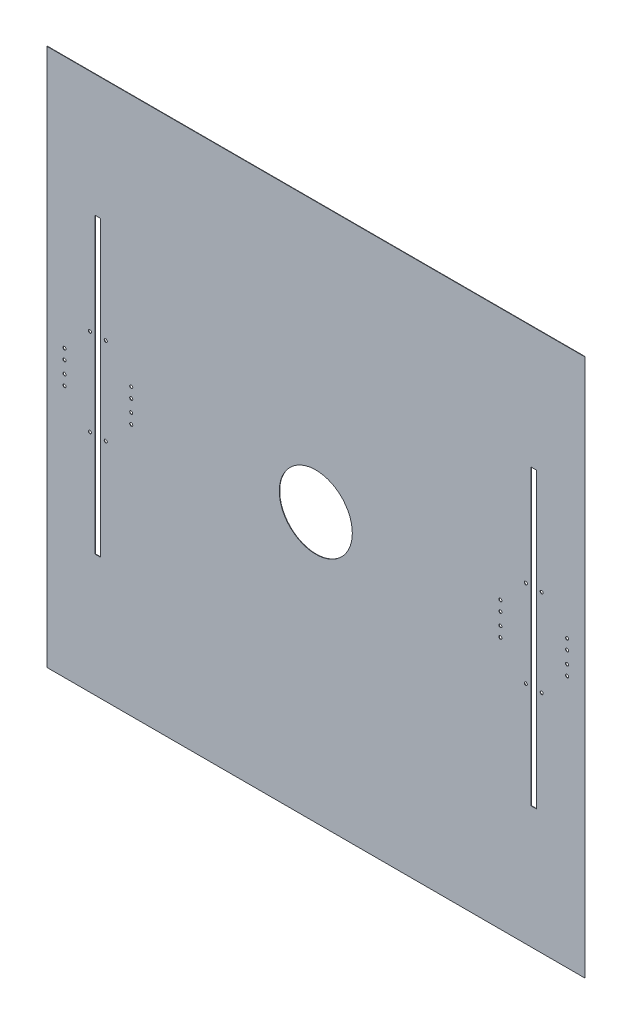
ISO-10303-21;
HEADER;
FILE_DESCRIPTION(('STEP AP214'),'2;1');
FILE_NAME('part.step','',(''),(''),'','','');
FILE_SCHEMA(('AUTOMOTIVE_DESIGN { 1 0 10303 214 1 1 1 1 }'));
ENDSEC;
DATA;
#1=APPLICATION_CONTEXT('core data for automotive mechanical design processes');
#2=APPLICATION_PROTOCOL_DEFINITION('international standard','automotive_design',2000,#1);
#3=PRODUCT_CONTEXT('',#1,'mechanical');
#4=PRODUCT('Part','Part','',(#3));
#5=PRODUCT_RELATED_PRODUCT_CATEGORY('part','',(#4));
#6=PRODUCT_DEFINITION_FORMATION('','',#4);
#7=PRODUCT_DEFINITION_CONTEXT('part definition',#1,'design');
#8=PRODUCT_DEFINITION('design','',#6,#7);
#9=PRODUCT_DEFINITION_SHAPE('','',#8);
#10=(LENGTH_UNIT() NAMED_UNIT(*) SI_UNIT(.MILLI.,.METRE.));
#11=(NAMED_UNIT(*) PLANE_ANGLE_UNIT() SI_UNIT($,.RADIAN.));
#12=(NAMED_UNIT(*) SI_UNIT($,.STERADIAN.) SOLID_ANGLE_UNIT());
#13=UNCERTAINTY_MEASURE_WITH_UNIT(LENGTH_MEASURE(1.E-05),#10,'distance_accuracy_value','');
#14=(GEOMETRIC_REPRESENTATION_CONTEXT(3) GLOBAL_UNCERTAINTY_ASSIGNED_CONTEXT((#13)) GLOBAL_UNIT_ASSIGNED_CONTEXT((#10,
#11,#12)) REPRESENTATION_CONTEXT('',''));
#15=CARTESIAN_POINT('',(0.,0.,0.));
#16=DIRECTION('',(0.,0.,1.));
#17=DIRECTION('',(1.,0.,0.));
#18=AXIS2_PLACEMENT_3D('',#15,#16,#17);
#19=CARTESIAN_POINT('',(-16.6671987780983,758.05667426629,-2.54));
#20=DIRECTION('',(-1.,0.,0.));
#21=DIRECTION('',(0.,0.,1.));
#22=AXIS2_PLACEMENT_3D('',#19,#20,#21);
#23=PLANE('',#22);
#24=DIRECTION('',(0.,-1.,0.));
#25=VECTOR('',#24,1.);
#26=CARTESIAN_POINT('',(-16.6671987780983,758.05667426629,0.));
#27=LINE('',#26,#25);
#28=CARTESIAN_POINT('',(-16.6671987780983,758.05667426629,0.));
#29=VERTEX_POINT('',#28);
#30=CARTESIAN_POINT('',(-16.6671987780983,-2594.74332573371,0.));
#31=VERTEX_POINT('',#30);
#32=EDGE_CURVE('E338',#29,#31,#27,.T.);
#33=ORIENTED_EDGE('',*,*,#32,.F.);
#34=DIRECTION('',(0.,0.,1.));
#35=VECTOR('',#34,1.);
#36=CARTESIAN_POINT('',(-16.6671987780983,758.05667426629,-2.54));
#37=LINE('',#36,#35);
#38=CARTESIAN_POINT('',(-16.6671987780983,758.05667426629,-2.54));
#39=VERTEX_POINT('',#38);
#40=EDGE_CURVE('E11',#39,#29,#37,.T.);
#41=ORIENTED_EDGE('',*,*,#40,.F.);
#42=DIRECTION('',(0.,-1.,0.));
#43=VECTOR('',#42,1.);
#44=CARTESIAN_POINT('',(-16.6671987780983,758.05667426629,-2.54));
#45=LINE('',#44,#43);
#46=CARTESIAN_POINT('',(-16.6671987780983,-2594.74332573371,-2.54));
#47=VERTEX_POINT('',#46);
#48=EDGE_CURVE('E341',#39,#47,#45,.T.);
#49=ORIENTED_EDGE('',*,*,#48,.T.);
#50=DIRECTION('',(0.,0.,1.));
#51=VECTOR('',#50,1.);
#52=CARTESIAN_POINT('',(-16.6671987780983,-2594.74332573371,-2.54));
#53=LINE('',#52,#51);
#54=EDGE_CURVE('E36',#47,#31,#53,.T.);
#55=ORIENTED_EDGE('',*,*,#54,.T.);
#56=EDGE_LOOP('',(#33,#41,#49,#55));
#57=FACE_BOUND('',#56,.T.);
#58=ADVANCED_FACE('F33',(#57),#23,.T.);
#59=CARTESIAN_POINT('',(-16.6671987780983,758.05667426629,-2.54));
#60=DIRECTION('',(0.,1.,0.));
#61=DIRECTION('',(-1.,0.,0.));
#62=AXIS2_PLACEMENT_3D('',#59,#60,#61);
#63=PLANE('',#62);
#64=DIRECTION('',(-1.,0.,0.));
#65=VECTOR('',#64,1.);
#66=CARTESIAN_POINT('',(-16.6671987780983,758.05667426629,0.));
#67=LINE('',#66,#65);
#68=CARTESIAN_POINT('',(3336.1328012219,758.056674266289,0.));
#69=VERTEX_POINT('',#68);
#70=EDGE_CURVE('E345',#69,#29,#67,.T.);
#71=ORIENTED_EDGE('',*,*,#70,.F.);
#72=DIRECTION('',(0.,0.,1.));
#73=VECTOR('',#72,1.);
#74=CARTESIAN_POINT('',(3336.1328012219,758.056674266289,-2.54));
#75=LINE('',#74,#73);
#76=CARTESIAN_POINT('',(3336.1328012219,758.056674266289,-2.54));
#77=VERTEX_POINT('',#76);
#78=EDGE_CURVE('E41',#77,#69,#75,.T.);
#79=ORIENTED_EDGE('',*,*,#78,.F.);
#80=DIRECTION('',(-1.,0.,0.));
#81=VECTOR('',#80,1.);
#82=CARTESIAN_POINT('',(-16.6671987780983,758.05667426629,-2.54));
#83=LINE('',#82,#81);
#84=EDGE_CURVE('E351',#77,#39,#83,.T.);
#85=ORIENTED_EDGE('',*,*,#84,.T.);
#86=ORIENTED_EDGE('',*,*,#40,.T.);
#87=EDGE_LOOP('',(#71,#79,#85,#86));
#88=FACE_BOUND('',#87,.T.);
#89=ADVANCED_FACE('F377',(#88),#63,.T.);
#90=CARTESIAN_POINT('',(3336.1328012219,758.056674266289,-2.54));
#91=DIRECTION('',(1.,0.,0.));
#92=DIRECTION('',(0.,1.,0.));
#93=AXIS2_PLACEMENT_3D('',#90,#91,#92);
#94=PLANE('',#93);
#95=DIRECTION('',(0.,1.,0.));
#96=VECTOR('',#95,1.);
#97=CARTESIAN_POINT('',(3336.1328012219,758.056674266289,0.));
#98=LINE('',#97,#96);
#99=CARTESIAN_POINT('',(3336.1328012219,-2594.74332573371,0.));
#100=VERTEX_POINT('',#99);
#101=EDGE_CURVE('E359',#100,#69,#98,.T.);
#102=ORIENTED_EDGE('',*,*,#101,.F.);
#103=DIRECTION('',(0.,0.,1.));
#104=VECTOR('',#103,1.);
#105=CARTESIAN_POINT('',(3336.1328012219,-2594.74332573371,-2.54));
#106=LINE('',#105,#104);
#107=CARTESIAN_POINT('',(3336.1328012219,-2594.74332573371,-2.54));
#108=VERTEX_POINT('',#107);
#109=EDGE_CURVE('E364',#108,#100,#106,.T.);
#110=ORIENTED_EDGE('',*,*,#109,.F.);
#111=DIRECTION('',(0.,1.,0.));
#112=VECTOR('',#111,1.);
#113=CARTESIAN_POINT('',(3336.1328012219,758.056674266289,-2.54));
#114=LINE('',#113,#112);
#115=EDGE_CURVE('E348',#108,#77,#114,.T.);
#116=ORIENTED_EDGE('',*,*,#115,.T.);
#117=ORIENTED_EDGE('',*,*,#78,.T.);
#118=EDGE_LOOP('',(#102,#110,#116,#117));
#119=FACE_BOUND('',#118,.T.);
#120=ADVANCED_FACE('F382',(#119),#94,.T.);
#121=CARTESIAN_POINT('',(-16.6671987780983,-2594.74332573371,-2.54));
#122=DIRECTION('',(0.,-1.,0.));
#123=DIRECTION('',(1.,0.,0.));
#124=AXIS2_PLACEMENT_3D('',#121,#122,#123);
#125=PLANE('',#124);
#126=DIRECTION('',(1.,0.,0.));
#127=VECTOR('',#126,1.);
#128=CARTESIAN_POINT('',(-16.6671987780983,-2594.74332573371,0.));
#129=LINE('',#128,#127);
#130=EDGE_CURVE('E356',#31,#100,#129,.T.);
#131=ORIENTED_EDGE('',*,*,#130,.F.);
#132=ORIENTED_EDGE('',*,*,#54,.F.);
#133=DIRECTION('',(1.,0.,0.));
#134=VECTOR('',#133,1.);
#135=CARTESIAN_POINT('',(-16.6671987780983,-2594.74332573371,-2.54));
#136=LINE('',#135,#134);
#137=EDGE_CURVE('E344',#47,#108,#136,.T.);
#138=ORIENTED_EDGE('',*,*,#137,.T.);
#139=ORIENTED_EDGE('',*,*,#109,.T.);
#140=EDGE_LOOP('',(#131,#132,#138,#139));
#141=FACE_BOUND('',#140,.T.);
#142=ADVANCED_FACE('F372',(#141),#125,.T.);
#143=CARTESIAN_POINT('',(0.,0.,-2.54));
#144=DIRECTION('',(0.,0.,1.));
#145=DIRECTION('',(1.,0.,0.));
#146=AXIS2_PLACEMENT_3D('',#143,#144,#145);
#147=PLANE('',#146);
#148=DIRECTION('',(-1.,0.,0.));
#149=VECTOR('',#148,1.);
#150=CARTESIAN_POINT('',(3000.09905833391,-3.94332573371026,-2.54));
#151=LINE('',#150,#149);
#152=CARTESIAN_POINT('',(3036.02008281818,-3.94332573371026,-2.54));
#153=VERTEX_POINT('',#152);
#154=CARTESIAN_POINT('',(3000.09905833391,-3.94332573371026,-2.54));
#155=VERTEX_POINT('',#154);
#156=EDGE_CURVE('E130',#153,#155,#151,.T.);
#157=ORIENTED_EDGE('',*,*,#156,.T.);
#158=DIRECTION('',(0.,-1.,0.));
#159=VECTOR('',#158,1.);
#160=CARTESIAN_POINT('',(3000.09905833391,-1832.74332573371,-2.54));
#161=LINE('',#160,#159);
#162=CARTESIAN_POINT('',(3000.09905833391,-1832.74332573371,-2.54));
#163=VERTEX_POINT('',#162);
#164=EDGE_CURVE('E124',#155,#163,#161,.T.);
#165=ORIENTED_EDGE('',*,*,#164,.T.);
#166=DIRECTION('',(1.,0.,0.));
#167=VECTOR('',#166,1.);
#168=CARTESIAN_POINT('',(3000.09905833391,-1832.74332573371,-2.54));
#169=LINE('',#168,#167);
#170=CARTESIAN_POINT('',(3036.02008281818,-1832.74332573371,-2.54));
#171=VERTEX_POINT('',#170);
#172=EDGE_CURVE('E133',#163,#171,#169,.T.);
#173=ORIENTED_EDGE('',*,*,#172,.T.);
#174=DIRECTION('',(0.,1.,0.));
#175=VECTOR('',#174,1.);
#176=CARTESIAN_POINT('',(3036.02008281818,-1832.74332573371,-2.54));
#177=LINE('',#176,#175);
#178=EDGE_CURVE('E49',#171,#153,#177,.T.);
#179=ORIENTED_EDGE('',*,*,#178,.T.);
#180=EDGE_LOOP('',(#157,#165,#173,#179));
#181=FACE_BOUND('',#180,.T.);
#182=CARTESIAN_POINT('',(1659.7328012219,-918.34332573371,-2.54));
#183=DIRECTION('',(0.,0.,1.));
#184=DIRECTION('',(1.,0.,0.));
#185=AXIS2_PLACEMENT_3D('',#182,#183,#184);
#186=CIRCLE('',#185,227.582044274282);
#187=CARTESIAN_POINT('',(1887.31484549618,-918.34332573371,-2.54));
#188=VERTEX_POINT('',#187);
#189=EDGE_CURVE('E159',#188,#188,#186,.T.);
#190=ORIENTED_EDGE('',*,*,#189,.T.);
#191=EDGE_LOOP('',(#190));
#192=FACE_BOUND('',#191,.T.);
#193=DIRECTION('',(-1.,0.,0.));
#194=VECTOR('',#193,1.);
#195=CARTESIAN_POINT('',(283.515165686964,-3.94332573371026,-2.54));
#196=LINE('',#195,#194);
#197=CARTESIAN_POINT('',(319.43619017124,-3.94332573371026,-2.54));
#198=VERTEX_POINT('',#197);
#199=CARTESIAN_POINT('',(283.515165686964,-3.94332573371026,-2.54));
#200=VERTEX_POINT('',#199);
#201=EDGE_CURVE('E175',#198,#200,#196,.T.);
#202=ORIENTED_EDGE('',*,*,#201,.T.);
#203=DIRECTION('',(0.,-1.,0.));
#204=VECTOR('',#203,1.);
#205=CARTESIAN_POINT('',(283.515165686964,-3.94332573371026,-2.54));
#206=LINE('',#205,#204);
#207=CARTESIAN_POINT('',(283.515165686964,-1832.74332573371,-2.54));
#208=VERTEX_POINT('',#207);
#209=EDGE_CURVE('E165',#200,#208,#206,.T.);
#210=ORIENTED_EDGE('',*,*,#209,.T.);
#211=DIRECTION('',(1.,0.,0.));
#212=VECTOR('',#211,1.);
#213=CARTESIAN_POINT('',(283.515165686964,-1832.74332573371,-2.54));
#214=LINE('',#213,#212);
#215=CARTESIAN_POINT('',(319.43619017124,-1832.74332573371,-2.54));
#216=VERTEX_POINT('',#215);
#217=EDGE_CURVE('E168',#208,#216,#214,.T.);
#218=ORIENTED_EDGE('',*,*,#217,.T.);
#219=DIRECTION('',(0.,1.,0.));
#220=VECTOR('',#219,1.);
#221=CARTESIAN_POINT('',(319.43619017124,-3.94332573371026,-2.54));
#222=LINE('',#221,#220);
#223=EDGE_CURVE('E172',#216,#198,#222,.T.);
#224=ORIENTED_EDGE('',*,*,#223,.T.);
#225=EDGE_LOOP('',(#202,#210,#218,#224));
#226=FACE_BOUND('',#225,.T.);
#227=CARTESIAN_POINT('',(3067.27207057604,-1189.77906961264,-2.54));
#228=DIRECTION('',(0.,0.,1.));
#229=DIRECTION('',(1.,0.,0.));
#230=AXIS2_PLACEMENT_3D('',#227,#228,#229);
#231=CIRCLE('',#230,9.52499999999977);
#232=CARTESIAN_POINT('',(3076.79707057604,-1189.77906961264,-2.54));
#233=VERTEX_POINT('',#232);
#234=EDGE_CURVE('E197',#233,#233,#231,.T.);
#235=ORIENTED_EDGE('',*,*,#234,.T.);
#236=EDGE_LOOP('',(#235));
#237=FACE_BOUND('',#236,.T.);
#238=CARTESIAN_POINT('',(2968.84707057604,-1189.77906961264,-2.54));
#239=DIRECTION('',(0.,0.,1.));
#240=DIRECTION('',(1.,0.,0.));
#241=AXIS2_PLACEMENT_3D('',#238,#239,#240);
#242=CIRCLE('',#241,9.52499999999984);
#243=CARTESIAN_POINT('',(2978.37207057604,-1189.77906961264,-2.54));
#244=VERTEX_POINT('',#243);
#245=EDGE_CURVE('E203',#244,#244,#242,.T.);
#246=ORIENTED_EDGE('',*,*,#245,.T.);
#247=EDGE_LOOP('',(#246));
#248=FACE_BOUND('',#247,.T.);
#249=CARTESIAN_POINT('',(3067.27207057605,-646.90758185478,-2.54));
#250=DIRECTION('',(0.,0.,1.));
#251=DIRECTION('',(1.,0.,0.));
#252=AXIS2_PLACEMENT_3D('',#249,#250,#251);
#253=CIRCLE('',#252,9.52499999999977);
#254=CARTESIAN_POINT('',(3076.79707057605,-646.90758185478,-2.54));
#255=VERTEX_POINT('',#254);
#256=EDGE_CURVE('E209',#255,#255,#253,.T.);
#257=ORIENTED_EDGE('',*,*,#256,.T.);
#258=EDGE_LOOP('',(#257));
#259=FACE_BOUND('',#258,.T.);
#260=CARTESIAN_POINT('',(2968.84707057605,-646.90758185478,-2.54));
#261=DIRECTION('',(0.,0.,1.));
#262=DIRECTION('',(1.,0.,0.));
#263=AXIS2_PLACEMENT_3D('',#260,#261,#262);
#264=CIRCLE('',#263,9.52499999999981);
#265=CARTESIAN_POINT('',(2978.37207057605,-646.90758185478,-2.54));
#266=VERTEX_POINT('',#265);
#267=EDGE_CURVE('E215',#266,#266,#264,.T.);
#268=ORIENTED_EDGE('',*,*,#267,.T.);
#269=EDGE_LOOP('',(#268));
#270=FACE_BOUND('',#269,.T.);
#271=CARTESIAN_POINT('',(2810.09707057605,-816.743325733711,-2.54));
#272=DIRECTION('',(0.,0.,1.));
#273=DIRECTION('',(1.,0.,0.));
#274=AXIS2_PLACEMENT_3D('',#271,#272,#273);
#275=CIRCLE('',#274,9.52500000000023);
#276=CARTESIAN_POINT('',(2819.62207057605,-816.743325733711,-2.54));
#277=VERTEX_POINT('',#276);
#278=EDGE_CURVE('E221',#277,#277,#275,.T.);
#279=ORIENTED_EDGE('',*,*,#278,.T.);
#280=EDGE_LOOP('',(#279));
#281=FACE_BOUND('',#280,.T.);
#282=CARTESIAN_POINT('',(2810.09707057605,-880.243325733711,-2.54));
#283=DIRECTION('',(0.,0.,1.));
#284=DIRECTION('',(1.,0.,0.));
#285=AXIS2_PLACEMENT_3D('',#282,#283,#284);
#286=CIRCLE('',#285,9.52499999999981);
#287=CARTESIAN_POINT('',(2819.62207057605,-880.243325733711,-2.54));
#288=VERTEX_POINT('',#287);
#289=EDGE_CURVE('E227',#288,#288,#286,.T.);
#290=ORIENTED_EDGE('',*,*,#289,.T.);
#291=EDGE_LOOP('',(#290));
#292=FACE_BOUND('',#291,.T.);
#293=CARTESIAN_POINT('',(2810.09707057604,-956.443325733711,-2.54));
#294=DIRECTION('',(0.,0.,1.));
#295=DIRECTION('',(1.,0.,0.));
#296=AXIS2_PLACEMENT_3D('',#293,#294,#295);
#297=CIRCLE('',#296,9.52499999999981);
#298=CARTESIAN_POINT('',(2819.62207057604,-956.443325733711,-2.54));
#299=VERTEX_POINT('',#298);
#300=EDGE_CURVE('E233',#299,#299,#297,.T.);
#301=ORIENTED_EDGE('',*,*,#300,.T.);
#302=EDGE_LOOP('',(#301));
#303=FACE_BOUND('',#302,.T.);
#304=CARTESIAN_POINT('',(2810.09707057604,-1019.94332573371,-2.54));
#305=DIRECTION('',(0.,0.,1.));
#306=DIRECTION('',(1.,0.,0.));
#307=AXIS2_PLACEMENT_3D('',#304,#305,#306);
#308=CIRCLE('',#307,9.52499999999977);
#309=CARTESIAN_POINT('',(2819.62207057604,-1019.94332573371,-2.54));
#310=VERTEX_POINT('',#309);
#311=EDGE_CURVE('E239',#310,#310,#308,.T.);
#312=ORIENTED_EDGE('',*,*,#311,.T.);
#313=EDGE_LOOP('',(#312));
#314=FACE_BOUND('',#313,.T.);
#315=CARTESIAN_POINT('',(3226.02207057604,-1019.94332573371,-2.54));
#316=DIRECTION('',(0.,0.,1.));
#317=DIRECTION('',(1.,0.,0.));
#318=AXIS2_PLACEMENT_3D('',#315,#316,#317);
#319=CIRCLE('',#318,9.52500000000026);
#320=CARTESIAN_POINT('',(3235.54707057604,-1019.94332573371,-2.54));
#321=VERTEX_POINT('',#320);
#322=EDGE_CURVE('E245',#321,#321,#319,.T.);
#323=ORIENTED_EDGE('',*,*,#322,.T.);
#324=EDGE_LOOP('',(#323));
#325=FACE_BOUND('',#324,.T.);
#326=CARTESIAN_POINT('',(3226.02207057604,-956.44332573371,-2.54));
#327=DIRECTION('',(0.,0.,1.));
#328=DIRECTION('',(1.,0.,0.));
#329=AXIS2_PLACEMENT_3D('',#326,#327,#328);
#330=CIRCLE('',#329,9.52500000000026);
#331=CARTESIAN_POINT('',(3235.54707057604,-956.44332573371,-2.54));
#332=VERTEX_POINT('',#331);
#333=EDGE_CURVE('E251',#332,#332,#330,.T.);
#334=ORIENTED_EDGE('',*,*,#333,.T.);
#335=EDGE_LOOP('',(#334));
#336=FACE_BOUND('',#335,.T.);
#337=CARTESIAN_POINT('',(3226.02207057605,-880.24332573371,-2.54));
#338=DIRECTION('',(0.,0.,1.));
#339=DIRECTION('',(1.,0.,0.));
#340=AXIS2_PLACEMENT_3D('',#337,#338,#339);
#341=CIRCLE('',#340,9.52499999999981);
#342=CARTESIAN_POINT('',(3235.54707057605,-880.24332573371,-2.54));
#343=VERTEX_POINT('',#342);
#344=EDGE_CURVE('E257',#343,#343,#341,.T.);
#345=ORIENTED_EDGE('',*,*,#344,.T.);
#346=EDGE_LOOP('',(#345));
#347=FACE_BOUND('',#346,.T.);
#348=CARTESIAN_POINT('',(3226.02207057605,-816.74332573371,-2.54));
#349=DIRECTION('',(0.,0.,1.));
#350=DIRECTION('',(1.,0.,0.));
#351=AXIS2_PLACEMENT_3D('',#348,#349,#350);
#352=CIRCLE('',#351,9.52500000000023);
#353=CARTESIAN_POINT('',(3235.54707057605,-816.74332573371,-2.54));
#354=VERTEX_POINT('',#353);
#355=EDGE_CURVE('E263',#354,#354,#352,.T.);
#356=ORIENTED_EDGE('',*,*,#355,.T.);
#357=EDGE_LOOP('',(#356));
#358=FACE_BOUND('',#357,.T.);
#359=CARTESIAN_POINT('',(509.438177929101,-880.243325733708,-2.54));
#360=DIRECTION('',(0.,0.,1.));
#361=DIRECTION('',(1.,0.,0.));
#362=AXIS2_PLACEMENT_3D('',#359,#360,#361);
#363=CIRCLE('',#362,9.52500000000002);
#364=CARTESIAN_POINT('',(518.963177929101,-880.243325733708,-2.54));
#365=VERTEX_POINT('',#364);
#366=EDGE_CURVE('E269',#365,#365,#363,.T.);
#367=ORIENTED_EDGE('',*,*,#366,.T.);
#368=EDGE_LOOP('',(#367));
#369=FACE_BOUND('',#368,.T.);
#370=CARTESIAN_POINT('',(509.438177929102,-956.44332573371,-2.54));
#371=DIRECTION('',(0.,0.,1.));
#372=DIRECTION('',(1.,0.,0.));
#373=AXIS2_PLACEMENT_3D('',#370,#371,#372);
#374=CIRCLE('',#373,9.52500000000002);
#375=CARTESIAN_POINT('',(518.963177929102,-956.44332573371,-2.54));
#376=VERTEX_POINT('',#375);
#377=EDGE_CURVE('E275',#376,#376,#374,.T.);
#378=ORIENTED_EDGE('',*,*,#377,.T.);
#379=EDGE_LOOP('',(#378));
#380=FACE_BOUND('',#379,.T.);
#381=CARTESIAN_POINT('',(509.438177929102,-1019.94332573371,-2.54));
#382=DIRECTION('',(0.,0.,1.));
#383=DIRECTION('',(1.,0.,0.));
#384=AXIS2_PLACEMENT_3D('',#381,#382,#383);
#385=CIRCLE('',#384,9.52499999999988);
#386=CARTESIAN_POINT('',(518.963177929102,-1019.94332573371,-2.54));
#387=VERTEX_POINT('',#386);
#388=EDGE_CURVE('E281',#387,#387,#385,.T.);
#389=ORIENTED_EDGE('',*,*,#388,.T.);
#390=EDGE_LOOP('',(#389));
#391=FACE_BOUND('',#390,.T.);
#392=CARTESIAN_POINT('',(350.688177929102,-1189.77906961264,-2.54));
#393=DIRECTION('',(0.,0.,1.));
#394=DIRECTION('',(1.,0.,0.));
#395=AXIS2_PLACEMENT_3D('',#392,#393,#394);
#396=CIRCLE('',#395,9.52500000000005);
#397=CARTESIAN_POINT('',(360.213177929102,-1189.77906961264,-2.54));
#398=VERTEX_POINT('',#397);
#399=EDGE_CURVE('E287',#398,#398,#396,.T.);
#400=ORIENTED_EDGE('',*,*,#399,.T.);
#401=EDGE_LOOP('',(#400));
#402=FACE_BOUND('',#401,.T.);
#403=CARTESIAN_POINT('',(252.263177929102,-1189.77906961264,-2.54));
#404=DIRECTION('',(0.,0.,1.));
#405=DIRECTION('',(1.,0.,0.));
#406=AXIS2_PLACEMENT_3D('',#403,#404,#405);
#407=CIRCLE('',#406,9.52500000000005);
#408=CARTESIAN_POINT('',(261.788177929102,-1189.77906961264,-2.54));
#409=VERTEX_POINT('',#408);
#410=EDGE_CURVE('E293',#409,#409,#407,.T.);
#411=ORIENTED_EDGE('',*,*,#410,.T.);
#412=EDGE_LOOP('',(#411));
#413=FACE_BOUND('',#412,.T.);
#414=CARTESIAN_POINT('',(93.5131779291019,-1019.94332573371,-2.54));
#415=DIRECTION('',(0.,0.,1.));
#416=DIRECTION('',(1.,0.,0.));
#417=AXIS2_PLACEMENT_3D('',#414,#415,#416);
#418=CIRCLE('',#417,9.52500000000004);
#419=CARTESIAN_POINT('',(103.038177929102,-1019.94332573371,-2.54));
#420=VERTEX_POINT('',#419);
#421=EDGE_CURVE('E299',#420,#420,#418,.T.);
#422=ORIENTED_EDGE('',*,*,#421,.T.);
#423=EDGE_LOOP('',(#422));
#424=FACE_BOUND('',#423,.T.);
#425=CARTESIAN_POINT('',(93.5131779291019,-956.44332573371,-2.54));
#426=DIRECTION('',(0.,0.,1.));
#427=DIRECTION('',(1.,0.,0.));
#428=AXIS2_PLACEMENT_3D('',#425,#426,#427);
#429=CIRCLE('',#428,9.52499999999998);
#430=CARTESIAN_POINT('',(103.038177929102,-956.44332573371,-2.54));
#431=VERTEX_POINT('',#430);
#432=EDGE_CURVE('E305',#431,#431,#429,.T.);
#433=ORIENTED_EDGE('',*,*,#432,.T.);
#434=EDGE_LOOP('',(#433));
#435=FACE_BOUND('',#434,.T.);
#436=CARTESIAN_POINT('',(93.5131779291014,-880.243325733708,-2.54));
#437=DIRECTION('',(0.,0.,1.));
#438=DIRECTION('',(1.,0.,0.));
#439=AXIS2_PLACEMENT_3D('',#436,#437,#438);
#440=CIRCLE('',#439,9.52499999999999);
#441=CARTESIAN_POINT('',(103.038177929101,-880.243325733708,-2.54));
#442=VERTEX_POINT('',#441);
#443=EDGE_CURVE('E311',#442,#442,#440,.T.);
#444=ORIENTED_EDGE('',*,*,#443,.T.);
#445=EDGE_LOOP('',(#444));
#446=FACE_BOUND('',#445,.T.);
#447=CARTESIAN_POINT('',(93.5131779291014,-816.743325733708,-2.54));
#448=DIRECTION('',(0.,0.,1.));
#449=DIRECTION('',(1.,0.,0.));
#450=AXIS2_PLACEMENT_3D('',#447,#448,#449);
#451=CIRCLE('',#450,9.525);
#452=CARTESIAN_POINT('',(103.038177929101,-816.743325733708,-2.54));
#453=VERTEX_POINT('',#452);
#454=EDGE_CURVE('E317',#453,#453,#451,.T.);
#455=ORIENTED_EDGE('',*,*,#454,.T.);
#456=EDGE_LOOP('',(#455));
#457=FACE_BOUND('',#456,.T.);
#458=CARTESIAN_POINT('',(509.438177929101,-816.743325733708,-2.54));
#459=DIRECTION('',(0.,0.,1.));
#460=DIRECTION('',(1.,0.,0.));
#461=AXIS2_PLACEMENT_3D('',#458,#459,#460);
#462=CIRCLE('',#461,9.67520100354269);
#463=CARTESIAN_POINT('',(519.113378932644,-816.743325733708,-2.54));
#464=VERTEX_POINT('',#463);
#465=EDGE_CURVE('E323',#464,#464,#462,.T.);
#466=ORIENTED_EDGE('',*,*,#465,.T.);
#467=EDGE_LOOP('',(#466));
#468=FACE_BOUND('',#467,.T.);
#469=CARTESIAN_POINT('',(350.688177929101,-646.907581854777,-2.54));
#470=DIRECTION('',(0.,0.,1.));
#471=DIRECTION('',(1.,0.,0.));
#472=AXIS2_PLACEMENT_3D('',#469,#470,#471);
#473=CIRCLE('',#472,9.52499999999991);
#474=CARTESIAN_POINT('',(360.213177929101,-646.907581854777,-2.54));
#475=VERTEX_POINT('',#474);
#476=EDGE_CURVE('E329',#475,#475,#473,.T.);
#477=ORIENTED_EDGE('',*,*,#476,.T.);
#478=EDGE_LOOP('',(#477));
#479=FACE_BOUND('',#478,.T.);
#480=CARTESIAN_POINT('',(252.263177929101,-646.907581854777,-2.54));
#481=DIRECTION('',(0.,0.,1.));
#482=DIRECTION('',(1.,0.,0.));
#483=AXIS2_PLACEMENT_3D('',#480,#481,#482);
#484=CIRCLE('',#483,9.52499999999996);
#485=CARTESIAN_POINT('',(261.788177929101,-646.907581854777,-2.54));
#486=VERTEX_POINT('',#485);
#487=EDGE_CURVE('E335',#486,#486,#484,.T.);
#488=ORIENTED_EDGE('',*,*,#487,.T.);
#489=EDGE_LOOP('',(#488));
#490=FACE_BOUND('',#489,.T.);
#491=ORIENTED_EDGE('',*,*,#48,.F.);
#492=ORIENTED_EDGE('',*,*,#84,.F.);
#493=ORIENTED_EDGE('',*,*,#115,.F.);
#494=ORIENTED_EDGE('',*,*,#137,.F.);
#495=EDGE_LOOP('',(#491,#492,#493,#494));
#496=FACE_BOUND('',#495,.T.);
#497=ADVANCED_FACE('F137',(#181,#192,#226,#237,#248,#259,#270,#281,#292,#303,#314,#325,#336,
#347,#358,#369,#380,#391,#402,#413,#424,#435,#446,#457,#468,#479,#490,#496),#147,.F.);
#498=CARTESIAN_POINT('',(0.,0.,0.));
#499=DIRECTION('',(0.,0.,1.));
#500=DIRECTION('',(1.,0.,0.));
#501=AXIS2_PLACEMENT_3D('',#498,#499,#500);
#502=PLANE('',#501);
#503=DIRECTION('',(0.,-1.,0.));
#504=VECTOR('',#503,1.);
#505=CARTESIAN_POINT('',(3000.09905833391,-1832.74332573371,0.));
#506=LINE('',#505,#504);
#507=CARTESIAN_POINT('',(3000.09905833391,-3.94332573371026,0.));
#508=VERTEX_POINT('',#507);
#509=CARTESIAN_POINT('',(3000.09905833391,-1832.74332573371,0.));
#510=VERTEX_POINT('',#509);
#511=EDGE_CURVE('E57',#508,#510,#506,.T.);
#512=ORIENTED_EDGE('',*,*,#511,.F.);
#513=DIRECTION('',(-1.,0.,0.));
#514=VECTOR('',#513,1.);
#515=CARTESIAN_POINT('',(3000.09905833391,-3.94332573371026,0.));
#516=LINE('',#515,#514);
#517=CARTESIAN_POINT('',(3036.02008281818,-3.94332573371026,0.));
#518=VERTEX_POINT('',#517);
#519=EDGE_CURVE('E140',#518,#508,#516,.T.);
#520=ORIENTED_EDGE('',*,*,#519,.F.);
#521=DIRECTION('',(0.,1.,0.));
#522=VECTOR('',#521,1.);
#523=CARTESIAN_POINT('',(3036.02008281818,-1832.74332573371,0.));
#524=LINE('',#523,#522);
#525=CARTESIAN_POINT('',(3036.02008281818,-1832.74332573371,0.));
#526=VERTEX_POINT('',#525);
#527=EDGE_CURVE('E143',#526,#518,#524,.T.);
#528=ORIENTED_EDGE('',*,*,#527,.F.);
#529=DIRECTION('',(1.,0.,0.));
#530=VECTOR('',#529,1.);
#531=CARTESIAN_POINT('',(3000.09905833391,-1832.74332573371,0.));
#532=LINE('',#531,#530);
#533=EDGE_CURVE('E149',#510,#526,#532,.T.);
#534=ORIENTED_EDGE('',*,*,#533,.F.);
#535=EDGE_LOOP('',(#512,#520,#528,#534));
#536=FACE_BOUND('',#535,.T.);
#537=CARTESIAN_POINT('',(1659.7328012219,-918.34332573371,0.));
#538=DIRECTION('',(0.,0.,1.));
#539=DIRECTION('',(1.,0.,0.));
#540=AXIS2_PLACEMENT_3D('',#537,#538,#539);
#541=CIRCLE('',#540,227.582044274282);
#542=CARTESIAN_POINT('',(1887.31484549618,-918.34332573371,0.));
#543=VERTEX_POINT('',#542);
#544=EDGE_CURVE('E155',#543,#543,#541,.T.);
#545=ORIENTED_EDGE('',*,*,#544,.F.);
#546=EDGE_LOOP('',(#545));
#547=FACE_BOUND('',#546,.T.);
#548=DIRECTION('',(0.,-1.,0.));
#549=VECTOR('',#548,1.);
#550=CARTESIAN_POINT('',(283.515165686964,-3.94332573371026,0.));
#551=LINE('',#550,#549);
#552=CARTESIAN_POINT('',(283.515165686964,-3.94332573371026,0.));
#553=VERTEX_POINT('',#552);
#554=CARTESIAN_POINT('',(283.515165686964,-1832.74332573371,0.));
#555=VERTEX_POINT('',#554);
#556=EDGE_CURVE('E162',#553,#555,#551,.T.);
#557=ORIENTED_EDGE('',*,*,#556,.F.);
#558=DIRECTION('',(-1.,0.,0.));
#559=VECTOR('',#558,1.);
#560=CARTESIAN_POINT('',(283.515165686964,-3.94332573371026,0.));
#561=LINE('',#560,#559);
#562=CARTESIAN_POINT('',(319.43619017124,-3.94332573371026,0.));
#563=VERTEX_POINT('',#562);
#564=EDGE_CURVE('E169',#563,#553,#561,.T.);
#565=ORIENTED_EDGE('',*,*,#564,.F.);
#566=DIRECTION('',(0.,1.,0.));
#567=VECTOR('',#566,1.);
#568=CARTESIAN_POINT('',(319.43619017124,-3.94332573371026,0.));
#569=LINE('',#568,#567);
#570=CARTESIAN_POINT('',(319.43619017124,-1832.74332573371,0.));
#571=VERTEX_POINT('',#570);
#572=EDGE_CURVE('E183',#571,#563,#569,.T.);
#573=ORIENTED_EDGE('',*,*,#572,.F.);
#574=DIRECTION('',(1.,0.,0.));
#575=VECTOR('',#574,1.);
#576=CARTESIAN_POINT('',(283.515165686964,-1832.74332573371,0.));
#577=LINE('',#576,#575);
#578=EDGE_CURVE('E180',#555,#571,#577,.T.);
#579=ORIENTED_EDGE('',*,*,#578,.F.);
#580=EDGE_LOOP('',(#557,#565,#573,#579));
#581=FACE_BOUND('',#580,.T.);
#582=CARTESIAN_POINT('',(3067.27207057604,-1189.77906961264,0.));
#583=DIRECTION('',(0.,0.,1.));
#584=DIRECTION('',(1.,0.,0.));
#585=AXIS2_PLACEMENT_3D('',#582,#583,#584);
#586=CIRCLE('',#585,9.52499999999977);
#587=CARTESIAN_POINT('',(3076.79707057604,-1189.77906961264,0.));
#588=VERTEX_POINT('',#587);
#589=EDGE_CURVE('E190',#588,#588,#586,.T.);
#590=ORIENTED_EDGE('',*,*,#589,.F.);
#591=EDGE_LOOP('',(#590));
#592=FACE_BOUND('',#591,.T.);
#593=CARTESIAN_POINT('',(2968.84707057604,-1189.77906961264,0.));
#594=DIRECTION('',(0.,0.,1.));
#595=DIRECTION('',(1.,0.,0.));
#596=AXIS2_PLACEMENT_3D('',#593,#594,#595);
#597=CIRCLE('',#596,9.52499999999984);
#598=CARTESIAN_POINT('',(2978.37207057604,-1189.77906961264,0.));
#599=VERTEX_POINT('',#598);
#600=EDGE_CURVE('E200',#599,#599,#597,.T.);
#601=ORIENTED_EDGE('',*,*,#600,.F.);
#602=EDGE_LOOP('',(#601));
#603=FACE_BOUND('',#602,.T.);
#604=CARTESIAN_POINT('',(3067.27207057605,-646.90758185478,0.));
#605=DIRECTION('',(0.,0.,1.));
#606=DIRECTION('',(1.,0.,0.));
#607=AXIS2_PLACEMENT_3D('',#604,#605,#606);
#608=CIRCLE('',#607,9.52499999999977);
#609=CARTESIAN_POINT('',(3076.79707057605,-646.90758185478,0.));
#610=VERTEX_POINT('',#609);
#611=EDGE_CURVE('E206',#610,#610,#608,.T.);
#612=ORIENTED_EDGE('',*,*,#611,.F.);
#613=EDGE_LOOP('',(#612));
#614=FACE_BOUND('',#613,.T.);
#615=CARTESIAN_POINT('',(2968.84707057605,-646.90758185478,0.));
#616=DIRECTION('',(0.,0.,1.));
#617=DIRECTION('',(1.,0.,0.));
#618=AXIS2_PLACEMENT_3D('',#615,#616,#617);
#619=CIRCLE('',#618,9.52499999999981);
#620=CARTESIAN_POINT('',(2978.37207057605,-646.90758185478,0.));
#621=VERTEX_POINT('',#620);
#622=EDGE_CURVE('E212',#621,#621,#619,.T.);
#623=ORIENTED_EDGE('',*,*,#622,.F.);
#624=EDGE_LOOP('',(#623));
#625=FACE_BOUND('',#624,.T.);
#626=CARTESIAN_POINT('',(2810.09707057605,-816.743325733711,0.));
#627=DIRECTION('',(0.,0.,1.));
#628=DIRECTION('',(1.,0.,0.));
#629=AXIS2_PLACEMENT_3D('',#626,#627,#628);
#630=CIRCLE('',#629,9.52500000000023);
#631=CARTESIAN_POINT('',(2819.62207057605,-816.743325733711,0.));
#632=VERTEX_POINT('',#631);
#633=EDGE_CURVE('E218',#632,#632,#630,.T.);
#634=ORIENTED_EDGE('',*,*,#633,.F.);
#635=EDGE_LOOP('',(#634));
#636=FACE_BOUND('',#635,.T.);
#637=CARTESIAN_POINT('',(2810.09707057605,-880.243325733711,0.));
#638=DIRECTION('',(0.,0.,1.));
#639=DIRECTION('',(1.,0.,0.));
#640=AXIS2_PLACEMENT_3D('',#637,#638,#639);
#641=CIRCLE('',#640,9.52499999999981);
#642=CARTESIAN_POINT('',(2819.62207057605,-880.243325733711,0.));
#643=VERTEX_POINT('',#642);
#644=EDGE_CURVE('E224',#643,#643,#641,.T.);
#645=ORIENTED_EDGE('',*,*,#644,.F.);
#646=EDGE_LOOP('',(#645));
#647=FACE_BOUND('',#646,.T.);
#648=CARTESIAN_POINT('',(2810.09707057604,-956.443325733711,0.));
#649=DIRECTION('',(0.,0.,1.));
#650=DIRECTION('',(1.,0.,0.));
#651=AXIS2_PLACEMENT_3D('',#648,#649,#650);
#652=CIRCLE('',#651,9.52499999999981);
#653=CARTESIAN_POINT('',(2819.62207057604,-956.443325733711,0.));
#654=VERTEX_POINT('',#653);
#655=EDGE_CURVE('E230',#654,#654,#652,.T.);
#656=ORIENTED_EDGE('',*,*,#655,.F.);
#657=EDGE_LOOP('',(#656));
#658=FACE_BOUND('',#657,.T.);
#659=CARTESIAN_POINT('',(2810.09707057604,-1019.94332573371,0.));
#660=DIRECTION('',(0.,0.,1.));
#661=DIRECTION('',(1.,0.,0.));
#662=AXIS2_PLACEMENT_3D('',#659,#660,#661);
#663=CIRCLE('',#662,9.52499999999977);
#664=CARTESIAN_POINT('',(2819.62207057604,-1019.94332573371,0.));
#665=VERTEX_POINT('',#664);
#666=EDGE_CURVE('E236',#665,#665,#663,.T.);
#667=ORIENTED_EDGE('',*,*,#666,.F.);
#668=EDGE_LOOP('',(#667));
#669=FACE_BOUND('',#668,.T.);
#670=CARTESIAN_POINT('',(3226.02207057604,-1019.94332573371,0.));
#671=DIRECTION('',(0.,0.,1.));
#672=DIRECTION('',(1.,0.,0.));
#673=AXIS2_PLACEMENT_3D('',#670,#671,#672);
#674=CIRCLE('',#673,9.52500000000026);
#675=CARTESIAN_POINT('',(3235.54707057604,-1019.94332573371,0.));
#676=VERTEX_POINT('',#675);
#677=EDGE_CURVE('E242',#676,#676,#674,.T.);
#678=ORIENTED_EDGE('',*,*,#677,.F.);
#679=EDGE_LOOP('',(#678));
#680=FACE_BOUND('',#679,.T.);
#681=CARTESIAN_POINT('',(3226.02207057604,-956.44332573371,0.));
#682=DIRECTION('',(0.,0.,1.));
#683=DIRECTION('',(1.,0.,0.));
#684=AXIS2_PLACEMENT_3D('',#681,#682,#683);
#685=CIRCLE('',#684,9.52500000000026);
#686=CARTESIAN_POINT('',(3235.54707057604,-956.44332573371,0.));
#687=VERTEX_POINT('',#686);
#688=EDGE_CURVE('E248',#687,#687,#685,.T.);
#689=ORIENTED_EDGE('',*,*,#688,.F.);
#690=EDGE_LOOP('',(#689));
#691=FACE_BOUND('',#690,.T.);
#692=CARTESIAN_POINT('',(3226.02207057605,-880.24332573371,0.));
#693=DIRECTION('',(0.,0.,1.));
#694=DIRECTION('',(1.,0.,0.));
#695=AXIS2_PLACEMENT_3D('',#692,#693,#694);
#696=CIRCLE('',#695,9.52499999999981);
#697=CARTESIAN_POINT('',(3235.54707057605,-880.24332573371,0.));
#698=VERTEX_POINT('',#697);
#699=EDGE_CURVE('E254',#698,#698,#696,.T.);
#700=ORIENTED_EDGE('',*,*,#699,.F.);
#701=EDGE_LOOP('',(#700));
#702=FACE_BOUND('',#701,.T.);
#703=CARTESIAN_POINT('',(3226.02207057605,-816.74332573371,0.));
#704=DIRECTION('',(0.,0.,1.));
#705=DIRECTION('',(1.,0.,0.));
#706=AXIS2_PLACEMENT_3D('',#703,#704,#705);
#707=CIRCLE('',#706,9.52500000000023);
#708=CARTESIAN_POINT('',(3235.54707057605,-816.74332573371,0.));
#709=VERTEX_POINT('',#708);
#710=EDGE_CURVE('E260',#709,#709,#707,.T.);
#711=ORIENTED_EDGE('',*,*,#710,.F.);
#712=EDGE_LOOP('',(#711));
#713=FACE_BOUND('',#712,.T.);
#714=CARTESIAN_POINT('',(509.438177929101,-880.243325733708,0.));
#715=DIRECTION('',(0.,0.,1.));
#716=DIRECTION('',(1.,0.,0.));
#717=AXIS2_PLACEMENT_3D('',#714,#715,#716);
#718=CIRCLE('',#717,9.52500000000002);
#719=CARTESIAN_POINT('',(518.963177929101,-880.243325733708,0.));
#720=VERTEX_POINT('',#719);
#721=EDGE_CURVE('E266',#720,#720,#718,.T.);
#722=ORIENTED_EDGE('',*,*,#721,.F.);
#723=EDGE_LOOP('',(#722));
#724=FACE_BOUND('',#723,.T.);
#725=CARTESIAN_POINT('',(509.438177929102,-956.44332573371,0.));
#726=DIRECTION('',(0.,0.,1.));
#727=DIRECTION('',(1.,0.,0.));
#728=AXIS2_PLACEMENT_3D('',#725,#726,#727);
#729=CIRCLE('',#728,9.52500000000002);
#730=CARTESIAN_POINT('',(518.963177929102,-956.44332573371,0.));
#731=VERTEX_POINT('',#730);
#732=EDGE_CURVE('E272',#731,#731,#729,.T.);
#733=ORIENTED_EDGE('',*,*,#732,.F.);
#734=EDGE_LOOP('',(#733));
#735=FACE_BOUND('',#734,.T.);
#736=CARTESIAN_POINT('',(509.438177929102,-1019.94332573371,0.));
#737=DIRECTION('',(0.,0.,1.));
#738=DIRECTION('',(1.,0.,0.));
#739=AXIS2_PLACEMENT_3D('',#736,#737,#738);
#740=CIRCLE('',#739,9.52499999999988);
#741=CARTESIAN_POINT('',(518.963177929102,-1019.94332573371,0.));
#742=VERTEX_POINT('',#741);
#743=EDGE_CURVE('E278',#742,#742,#740,.T.);
#744=ORIENTED_EDGE('',*,*,#743,.F.);
#745=EDGE_LOOP('',(#744));
#746=FACE_BOUND('',#745,.T.);
#747=CARTESIAN_POINT('',(350.688177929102,-1189.77906961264,0.));
#748=DIRECTION('',(0.,0.,1.));
#749=DIRECTION('',(1.,0.,0.));
#750=AXIS2_PLACEMENT_3D('',#747,#748,#749);
#751=CIRCLE('',#750,9.52500000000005);
#752=CARTESIAN_POINT('',(360.213177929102,-1189.77906961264,0.));
#753=VERTEX_POINT('',#752);
#754=EDGE_CURVE('E284',#753,#753,#751,.T.);
#755=ORIENTED_EDGE('',*,*,#754,.F.);
#756=EDGE_LOOP('',(#755));
#757=FACE_BOUND('',#756,.T.);
#758=CARTESIAN_POINT('',(252.263177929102,-1189.77906961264,0.));
#759=DIRECTION('',(0.,0.,1.));
#760=DIRECTION('',(1.,0.,0.));
#761=AXIS2_PLACEMENT_3D('',#758,#759,#760);
#762=CIRCLE('',#761,9.52500000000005);
#763=CARTESIAN_POINT('',(261.788177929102,-1189.77906961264,0.));
#764=VERTEX_POINT('',#763);
#765=EDGE_CURVE('E290',#764,#764,#762,.T.);
#766=ORIENTED_EDGE('',*,*,#765,.F.);
#767=EDGE_LOOP('',(#766));
#768=FACE_BOUND('',#767,.T.);
#769=CARTESIAN_POINT('',(93.5131779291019,-1019.94332573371,0.));
#770=DIRECTION('',(0.,0.,1.));
#771=DIRECTION('',(1.,0.,0.));
#772=AXIS2_PLACEMENT_3D('',#769,#770,#771);
#773=CIRCLE('',#772,9.52500000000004);
#774=CARTESIAN_POINT('',(103.038177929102,-1019.94332573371,0.));
#775=VERTEX_POINT('',#774);
#776=EDGE_CURVE('E296',#775,#775,#773,.T.);
#777=ORIENTED_EDGE('',*,*,#776,.F.);
#778=EDGE_LOOP('',(#777));
#779=FACE_BOUND('',#778,.T.);
#780=CARTESIAN_POINT('',(93.5131779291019,-956.44332573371,0.));
#781=DIRECTION('',(0.,0.,1.));
#782=DIRECTION('',(1.,0.,0.));
#783=AXIS2_PLACEMENT_3D('',#780,#781,#782);
#784=CIRCLE('',#783,9.52499999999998);
#785=CARTESIAN_POINT('',(103.038177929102,-956.44332573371,0.));
#786=VERTEX_POINT('',#785);
#787=EDGE_CURVE('E302',#786,#786,#784,.T.);
#788=ORIENTED_EDGE('',*,*,#787,.F.);
#789=EDGE_LOOP('',(#788));
#790=FACE_BOUND('',#789,.T.);
#791=CARTESIAN_POINT('',(93.5131779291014,-880.243325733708,0.));
#792=DIRECTION('',(0.,0.,1.));
#793=DIRECTION('',(1.,0.,0.));
#794=AXIS2_PLACEMENT_3D('',#791,#792,#793);
#795=CIRCLE('',#794,9.52499999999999);
#796=CARTESIAN_POINT('',(103.038177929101,-880.243325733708,0.));
#797=VERTEX_POINT('',#796);
#798=EDGE_CURVE('E308',#797,#797,#795,.T.);
#799=ORIENTED_EDGE('',*,*,#798,.F.);
#800=EDGE_LOOP('',(#799));
#801=FACE_BOUND('',#800,.T.);
#802=CARTESIAN_POINT('',(93.5131779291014,-816.743325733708,0.));
#803=DIRECTION('',(0.,0.,1.));
#804=DIRECTION('',(1.,0.,0.));
#805=AXIS2_PLACEMENT_3D('',#802,#803,#804);
#806=CIRCLE('',#805,9.525);
#807=CARTESIAN_POINT('',(103.038177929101,-816.743325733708,0.));
#808=VERTEX_POINT('',#807);
#809=EDGE_CURVE('E314',#808,#808,#806,.T.);
#810=ORIENTED_EDGE('',*,*,#809,.F.);
#811=EDGE_LOOP('',(#810));
#812=FACE_BOUND('',#811,.T.);
#813=CARTESIAN_POINT('',(509.438177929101,-816.743325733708,0.));
#814=DIRECTION('',(0.,0.,1.));
#815=DIRECTION('',(1.,0.,0.));
#816=AXIS2_PLACEMENT_3D('',#813,#814,#815);
#817=CIRCLE('',#816,9.67520100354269);
#818=CARTESIAN_POINT('',(519.113378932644,-816.743325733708,0.));
#819=VERTEX_POINT('',#818);
#820=EDGE_CURVE('E320',#819,#819,#817,.T.);
#821=ORIENTED_EDGE('',*,*,#820,.F.);
#822=EDGE_LOOP('',(#821));
#823=FACE_BOUND('',#822,.T.);
#824=CARTESIAN_POINT('',(350.688177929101,-646.907581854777,0.));
#825=DIRECTION('',(0.,0.,1.));
#826=DIRECTION('',(1.,0.,0.));
#827=AXIS2_PLACEMENT_3D('',#824,#825,#826);
#828=CIRCLE('',#827,9.52499999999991);
#829=CARTESIAN_POINT('',(360.213177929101,-646.907581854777,0.));
#830=VERTEX_POINT('',#829);
#831=EDGE_CURVE('E326',#830,#830,#828,.T.);
#832=ORIENTED_EDGE('',*,*,#831,.F.);
#833=EDGE_LOOP('',(#832));
#834=FACE_BOUND('',#833,.T.);
#835=CARTESIAN_POINT('',(252.263177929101,-646.907581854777,0.));
#836=DIRECTION('',(0.,0.,1.));
#837=DIRECTION('',(1.,0.,0.));
#838=AXIS2_PLACEMENT_3D('',#835,#836,#837);
#839=CIRCLE('',#838,9.52499999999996);
#840=CARTESIAN_POINT('',(261.788177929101,-646.907581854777,0.));
#841=VERTEX_POINT('',#840);
#842=EDGE_CURVE('E332',#841,#841,#839,.T.);
#843=ORIENTED_EDGE('',*,*,#842,.F.);
#844=EDGE_LOOP('',(#843));
#845=FACE_BOUND('',#844,.T.);
#846=ORIENTED_EDGE('',*,*,#32,.T.);
#847=ORIENTED_EDGE('',*,*,#130,.T.);
#848=ORIENTED_EDGE('',*,*,#101,.T.);
#849=ORIENTED_EDGE('',*,*,#70,.T.);
#850=EDGE_LOOP('',(#846,#847,#848,#849));
#851=FACE_BOUND('',#850,.T.);
#852=ADVANCED_FACE('F374',(#536,#547,#581,#592,#603,#614,#625,#636,#647,#658,#669,#680,#691,
#702,#713,#724,#735,#746,#757,#768,#779,#790,#801,#812,#823,#834,#845,#851),#502,.T.);
#853=CARTESIAN_POINT('',(252.263177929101,-646.907581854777,-2.54));
#854=DIRECTION('',(0.,0.,1.));
#855=DIRECTION('',(1.,0.,0.));
#856=AXIS2_PLACEMENT_3D('',#853,#854,#855);
#857=CYLINDRICAL_SURFACE('',#856,9.52499999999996);
#858=ORIENTED_EDGE('',*,*,#487,.F.);
#859=EDGE_LOOP('',(#858));
#860=FACE_BOUND('',#859,.T.);
#861=ORIENTED_EDGE('',*,*,#842,.T.);
#862=EDGE_LOOP('',(#861));
#863=FACE_BOUND('',#862,.T.);
#864=ADVANCED_FACE('F424',(#860,#863),#857,.F.);
#865=CARTESIAN_POINT('',(350.688177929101,-646.907581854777,-2.54));
#866=DIRECTION('',(0.,0.,1.));
#867=DIRECTION('',(1.,0.,0.));
#868=AXIS2_PLACEMENT_3D('',#865,#866,#867);
#869=CYLINDRICAL_SURFACE('',#868,9.52499999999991);
#870=ORIENTED_EDGE('',*,*,#476,.F.);
#871=EDGE_LOOP('',(#870));
#872=FACE_BOUND('',#871,.T.);
#873=ORIENTED_EDGE('',*,*,#831,.T.);
#874=EDGE_LOOP('',(#873));
#875=FACE_BOUND('',#874,.T.);
#876=ADVANCED_FACE('F434',(#872,#875),#869,.F.);
#877=CARTESIAN_POINT('',(509.438177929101,-816.743325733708,-2.54));
#878=DIRECTION('',(0.,0.,1.));
#879=DIRECTION('',(1.,0.,0.));
#880=AXIS2_PLACEMENT_3D('',#877,#878,#879);
#881=CYLINDRICAL_SURFACE('',#880,9.67520100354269);
#882=ORIENTED_EDGE('',*,*,#465,.F.);
#883=EDGE_LOOP('',(#882));
#884=FACE_BOUND('',#883,.T.);
#885=ORIENTED_EDGE('',*,*,#820,.T.);
#886=EDGE_LOOP('',(#885));
#887=FACE_BOUND('',#886,.T.);
#888=ADVANCED_FACE('F444',(#884,#887),#881,.F.);
#889=CARTESIAN_POINT('',(93.5131779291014,-816.743325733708,-2.54));
#890=DIRECTION('',(0.,0.,1.));
#891=DIRECTION('',(1.,0.,0.));
#892=AXIS2_PLACEMENT_3D('',#889,#890,#891);
#893=CYLINDRICAL_SURFACE('',#892,9.525);
#894=ORIENTED_EDGE('',*,*,#454,.F.);
#895=EDGE_LOOP('',(#894));
#896=FACE_BOUND('',#895,.T.);
#897=ORIENTED_EDGE('',*,*,#809,.T.);
#898=EDGE_LOOP('',(#897));
#899=FACE_BOUND('',#898,.T.);
#900=ADVANCED_FACE('F454',(#896,#899),#893,.F.);
#901=CARTESIAN_POINT('',(93.5131779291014,-880.243325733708,-2.54));
#902=DIRECTION('',(0.,0.,1.));
#903=DIRECTION('',(1.,0.,0.));
#904=AXIS2_PLACEMENT_3D('',#901,#902,#903);
#905=CYLINDRICAL_SURFACE('',#904,9.52499999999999);
#906=ORIENTED_EDGE('',*,*,#443,.F.);
#907=EDGE_LOOP('',(#906));
#908=FACE_BOUND('',#907,.T.);
#909=ORIENTED_EDGE('',*,*,#798,.T.);
#910=EDGE_LOOP('',(#909));
#911=FACE_BOUND('',#910,.T.);
#912=ADVANCED_FACE('F464',(#908,#911),#905,.F.);
#913=CARTESIAN_POINT('',(93.5131779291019,-956.44332573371,-2.54));
#914=DIRECTION('',(0.,0.,1.));
#915=DIRECTION('',(1.,0.,0.));
#916=AXIS2_PLACEMENT_3D('',#913,#914,#915);
#917=CYLINDRICAL_SURFACE('',#916,9.52499999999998);
#918=ORIENTED_EDGE('',*,*,#432,.F.);
#919=EDGE_LOOP('',(#918));
#920=FACE_BOUND('',#919,.T.);
#921=ORIENTED_EDGE('',*,*,#787,.T.);
#922=EDGE_LOOP('',(#921));
#923=FACE_BOUND('',#922,.T.);
#924=ADVANCED_FACE('F474',(#920,#923),#917,.F.);
#925=CARTESIAN_POINT('',(93.5131779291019,-1019.94332573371,-2.54));
#926=DIRECTION('',(0.,0.,1.));
#927=DIRECTION('',(1.,0.,0.));
#928=AXIS2_PLACEMENT_3D('',#925,#926,#927);
#929=CYLINDRICAL_SURFACE('',#928,9.52500000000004);
#930=ORIENTED_EDGE('',*,*,#421,.F.);
#931=EDGE_LOOP('',(#930));
#932=FACE_BOUND('',#931,.T.);
#933=ORIENTED_EDGE('',*,*,#776,.T.);
#934=EDGE_LOOP('',(#933));
#935=FACE_BOUND('',#934,.T.);
#936=ADVANCED_FACE('F484',(#932,#935),#929,.F.);
#937=CARTESIAN_POINT('',(252.263177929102,-1189.77906961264,-2.54));
#938=DIRECTION('',(0.,0.,1.));
#939=DIRECTION('',(1.,0.,0.));
#940=AXIS2_PLACEMENT_3D('',#937,#938,#939);
#941=CYLINDRICAL_SURFACE('',#940,9.52500000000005);
#942=ORIENTED_EDGE('',*,*,#410,.F.);
#943=EDGE_LOOP('',(#942));
#944=FACE_BOUND('',#943,.T.);
#945=ORIENTED_EDGE('',*,*,#765,.T.);
#946=EDGE_LOOP('',(#945));
#947=FACE_BOUND('',#946,.T.);
#948=ADVANCED_FACE('F494',(#944,#947),#941,.F.);
#949=CARTESIAN_POINT('',(350.688177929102,-1189.77906961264,-2.54));
#950=DIRECTION('',(0.,0.,1.));
#951=DIRECTION('',(1.,0.,0.));
#952=AXIS2_PLACEMENT_3D('',#949,#950,#951);
#953=CYLINDRICAL_SURFACE('',#952,9.52500000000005);
#954=ORIENTED_EDGE('',*,*,#399,.F.);
#955=EDGE_LOOP('',(#954));
#956=FACE_BOUND('',#955,.T.);
#957=ORIENTED_EDGE('',*,*,#754,.T.);
#958=EDGE_LOOP('',(#957));
#959=FACE_BOUND('',#958,.T.);
#960=ADVANCED_FACE('F504',(#956,#959),#953,.F.);
#961=CARTESIAN_POINT('',(509.438177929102,-1019.94332573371,-2.54));
#962=DIRECTION('',(0.,0.,1.));
#963=DIRECTION('',(1.,0.,0.));
#964=AXIS2_PLACEMENT_3D('',#961,#962,#963);
#965=CYLINDRICAL_SURFACE('',#964,9.52499999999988);
#966=ORIENTED_EDGE('',*,*,#388,.F.);
#967=EDGE_LOOP('',(#966));
#968=FACE_BOUND('',#967,.T.);
#969=ORIENTED_EDGE('',*,*,#743,.T.);
#970=EDGE_LOOP('',(#969));
#971=FACE_BOUND('',#970,.T.);
#972=ADVANCED_FACE('F514',(#968,#971),#965,.F.);
#973=CARTESIAN_POINT('',(509.438177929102,-956.44332573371,-2.54));
#974=DIRECTION('',(0.,0.,1.));
#975=DIRECTION('',(1.,0.,0.));
#976=AXIS2_PLACEMENT_3D('',#973,#974,#975);
#977=CYLINDRICAL_SURFACE('',#976,9.52500000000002);
#978=ORIENTED_EDGE('',*,*,#377,.F.);
#979=EDGE_LOOP('',(#978));
#980=FACE_BOUND('',#979,.T.);
#981=ORIENTED_EDGE('',*,*,#732,.T.);
#982=EDGE_LOOP('',(#981));
#983=FACE_BOUND('',#982,.T.);
#984=ADVANCED_FACE('F524',(#980,#983),#977,.F.);
#985=CARTESIAN_POINT('',(509.438177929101,-880.243325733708,-2.54));
#986=DIRECTION('',(0.,0.,1.));
#987=DIRECTION('',(1.,0.,0.));
#988=AXIS2_PLACEMENT_3D('',#985,#986,#987);
#989=CYLINDRICAL_SURFACE('',#988,9.52500000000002);
#990=ORIENTED_EDGE('',*,*,#366,.F.);
#991=EDGE_LOOP('',(#990));
#992=FACE_BOUND('',#991,.T.);
#993=ORIENTED_EDGE('',*,*,#721,.T.);
#994=EDGE_LOOP('',(#993));
#995=FACE_BOUND('',#994,.T.);
#996=ADVANCED_FACE('F534',(#992,#995),#989,.F.);
#997=CARTESIAN_POINT('',(3226.02207057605,-816.74332573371,-2.54));
#998=DIRECTION('',(0.,0.,1.));
#999=DIRECTION('',(1.,0.,0.));
#1000=AXIS2_PLACEMENT_3D('',#997,#998,#999);
#1001=CYLINDRICAL_SURFACE('',#1000,9.52500000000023);
#1002=ORIENTED_EDGE('',*,*,#355,.F.);
#1003=EDGE_LOOP('',(#1002));
#1004=FACE_BOUND('',#1003,.T.);
#1005=ORIENTED_EDGE('',*,*,#710,.T.);
#1006=EDGE_LOOP('',(#1005));
#1007=FACE_BOUND('',#1006,.T.);
#1008=ADVANCED_FACE('F544',(#1004,#1007),#1001,.F.);
#1009=CARTESIAN_POINT('',(3226.02207057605,-880.24332573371,-2.54));
#1010=DIRECTION('',(0.,0.,1.));
#1011=DIRECTION('',(1.,0.,0.));
#1012=AXIS2_PLACEMENT_3D('',#1009,#1010,#1011);
#1013=CYLINDRICAL_SURFACE('',#1012,9.52499999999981);
#1014=ORIENTED_EDGE('',*,*,#344,.F.);
#1015=EDGE_LOOP('',(#1014));
#1016=FACE_BOUND('',#1015,.T.);
#1017=ORIENTED_EDGE('',*,*,#699,.T.);
#1018=EDGE_LOOP('',(#1017));
#1019=FACE_BOUND('',#1018,.T.);
#1020=ADVANCED_FACE('F554',(#1016,#1019),#1013,.F.);
#1021=CARTESIAN_POINT('',(3226.02207057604,-956.44332573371,-2.54));
#1022=DIRECTION('',(0.,0.,1.));
#1023=DIRECTION('',(1.,0.,0.));
#1024=AXIS2_PLACEMENT_3D('',#1021,#1022,#1023);
#1025=CYLINDRICAL_SURFACE('',#1024,9.52500000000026);
#1026=ORIENTED_EDGE('',*,*,#333,.F.);
#1027=EDGE_LOOP('',(#1026));
#1028=FACE_BOUND('',#1027,.T.);
#1029=ORIENTED_EDGE('',*,*,#688,.T.);
#1030=EDGE_LOOP('',(#1029));
#1031=FACE_BOUND('',#1030,.T.);
#1032=ADVANCED_FACE('F564',(#1028,#1031),#1025,.F.);
#1033=CARTESIAN_POINT('',(3226.02207057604,-1019.94332573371,-2.54));
#1034=DIRECTION('',(0.,0.,1.));
#1035=DIRECTION('',(1.,0.,0.));
#1036=AXIS2_PLACEMENT_3D('',#1033,#1034,#1035);
#1037=CYLINDRICAL_SURFACE('',#1036,9.52500000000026);
#1038=ORIENTED_EDGE('',*,*,#322,.F.);
#1039=EDGE_LOOP('',(#1038));
#1040=FACE_BOUND('',#1039,.T.);
#1041=ORIENTED_EDGE('',*,*,#677,.T.);
#1042=EDGE_LOOP('',(#1041));
#1043=FACE_BOUND('',#1042,.T.);
#1044=ADVANCED_FACE('F574',(#1040,#1043),#1037,.F.);
#1045=CARTESIAN_POINT('',(2810.09707057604,-1019.94332573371,-2.54));
#1046=DIRECTION('',(0.,0.,1.));
#1047=DIRECTION('',(1.,0.,0.));
#1048=AXIS2_PLACEMENT_3D('',#1045,#1046,#1047);
#1049=CYLINDRICAL_SURFACE('',#1048,9.52499999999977);
#1050=ORIENTED_EDGE('',*,*,#311,.F.);
#1051=EDGE_LOOP('',(#1050));
#1052=FACE_BOUND('',#1051,.T.);
#1053=ORIENTED_EDGE('',*,*,#666,.T.);
#1054=EDGE_LOOP('',(#1053));
#1055=FACE_BOUND('',#1054,.T.);
#1056=ADVANCED_FACE('F584',(#1052,#1055),#1049,.F.);
#1057=CARTESIAN_POINT('',(2810.09707057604,-956.443325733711,-2.54));
#1058=DIRECTION('',(0.,0.,1.));
#1059=DIRECTION('',(1.,0.,0.));
#1060=AXIS2_PLACEMENT_3D('',#1057,#1058,#1059);
#1061=CYLINDRICAL_SURFACE('',#1060,9.52499999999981);
#1062=ORIENTED_EDGE('',*,*,#300,.F.);
#1063=EDGE_LOOP('',(#1062));
#1064=FACE_BOUND('',#1063,.T.);
#1065=ORIENTED_EDGE('',*,*,#655,.T.);
#1066=EDGE_LOOP('',(#1065));
#1067=FACE_BOUND('',#1066,.T.);
#1068=ADVANCED_FACE('F594',(#1064,#1067),#1061,.F.);
#1069=CARTESIAN_POINT('',(2810.09707057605,-880.243325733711,-2.54));
#1070=DIRECTION('',(0.,0.,1.));
#1071=DIRECTION('',(1.,0.,0.));
#1072=AXIS2_PLACEMENT_3D('',#1069,#1070,#1071);
#1073=CYLINDRICAL_SURFACE('',#1072,9.52499999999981);
#1074=ORIENTED_EDGE('',*,*,#289,.F.);
#1075=EDGE_LOOP('',(#1074));
#1076=FACE_BOUND('',#1075,.T.);
#1077=ORIENTED_EDGE('',*,*,#644,.T.);
#1078=EDGE_LOOP('',(#1077));
#1079=FACE_BOUND('',#1078,.T.);
#1080=ADVANCED_FACE('F604',(#1076,#1079),#1073,.F.);
#1081=CARTESIAN_POINT('',(2810.09707057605,-816.743325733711,-2.54));
#1082=DIRECTION('',(0.,0.,1.));
#1083=DIRECTION('',(1.,0.,0.));
#1084=AXIS2_PLACEMENT_3D('',#1081,#1082,#1083);
#1085=CYLINDRICAL_SURFACE('',#1084,9.52500000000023);
#1086=ORIENTED_EDGE('',*,*,#278,.F.);
#1087=EDGE_LOOP('',(#1086));
#1088=FACE_BOUND('',#1087,.T.);
#1089=ORIENTED_EDGE('',*,*,#633,.T.);
#1090=EDGE_LOOP('',(#1089));
#1091=FACE_BOUND('',#1090,.T.);
#1092=ADVANCED_FACE('F614',(#1088,#1091),#1085,.F.);
#1093=CARTESIAN_POINT('',(2968.84707057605,-646.90758185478,-2.54));
#1094=DIRECTION('',(0.,0.,1.));
#1095=DIRECTION('',(1.,0.,0.));
#1096=AXIS2_PLACEMENT_3D('',#1093,#1094,#1095);
#1097=CYLINDRICAL_SURFACE('',#1096,9.52499999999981);
#1098=ORIENTED_EDGE('',*,*,#267,.F.);
#1099=EDGE_LOOP('',(#1098));
#1100=FACE_BOUND('',#1099,.T.);
#1101=ORIENTED_EDGE('',*,*,#622,.T.);
#1102=EDGE_LOOP('',(#1101));
#1103=FACE_BOUND('',#1102,.T.);
#1104=ADVANCED_FACE('F624',(#1100,#1103),#1097,.F.);
#1105=CARTESIAN_POINT('',(3067.27207057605,-646.90758185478,-2.54));
#1106=DIRECTION('',(0.,0.,1.));
#1107=DIRECTION('',(1.,0.,0.));
#1108=AXIS2_PLACEMENT_3D('',#1105,#1106,#1107);
#1109=CYLINDRICAL_SURFACE('',#1108,9.52499999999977);
#1110=ORIENTED_EDGE('',*,*,#256,.F.);
#1111=EDGE_LOOP('',(#1110));
#1112=FACE_BOUND('',#1111,.T.);
#1113=ORIENTED_EDGE('',*,*,#611,.T.);
#1114=EDGE_LOOP('',(#1113));
#1115=FACE_BOUND('',#1114,.T.);
#1116=ADVANCED_FACE('F634',(#1112,#1115),#1109,.F.);
#1117=CARTESIAN_POINT('',(2968.84707057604,-1189.77906961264,-2.54));
#1118=DIRECTION('',(0.,0.,1.));
#1119=DIRECTION('',(1.,0.,0.));
#1120=AXIS2_PLACEMENT_3D('',#1117,#1118,#1119);
#1121=CYLINDRICAL_SURFACE('',#1120,9.52499999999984);
#1122=ORIENTED_EDGE('',*,*,#245,.F.);
#1123=EDGE_LOOP('',(#1122));
#1124=FACE_BOUND('',#1123,.T.);
#1125=ORIENTED_EDGE('',*,*,#600,.T.);
#1126=EDGE_LOOP('',(#1125));
#1127=FACE_BOUND('',#1126,.T.);
#1128=ADVANCED_FACE('F644',(#1124,#1127),#1121,.F.);
#1129=CARTESIAN_POINT('',(3067.27207057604,-1189.77906961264,-2.54));
#1130=DIRECTION('',(0.,0.,1.));
#1131=DIRECTION('',(1.,0.,0.));
#1132=AXIS2_PLACEMENT_3D('',#1129,#1130,#1131);
#1133=CYLINDRICAL_SURFACE('',#1132,9.52499999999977);
#1134=ORIENTED_EDGE('',*,*,#234,.F.);
#1135=EDGE_LOOP('',(#1134));
#1136=FACE_BOUND('',#1135,.T.);
#1137=ORIENTED_EDGE('',*,*,#589,.T.);
#1138=EDGE_LOOP('',(#1137));
#1139=FACE_BOUND('',#1138,.T.);
#1140=ADVANCED_FACE('F654',(#1136,#1139),#1133,.F.);
#1141=CARTESIAN_POINT('',(283.515165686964,-3.94332573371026,-2.54));
#1142=DIRECTION('',(-1.,0.,0.));
#1143=DIRECTION('',(0.,0.,1.));
#1144=AXIS2_PLACEMENT_3D('',#1141,#1142,#1143);
#1145=PLANE('',#1144);
#1146=ORIENTED_EDGE('',*,*,#556,.T.);
#1147=DIRECTION('',(0.,0.,1.));
#1148=VECTOR('',#1147,1.);
#1149=CARTESIAN_POINT('',(283.515165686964,-1832.74332573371,-2.54));
#1150=LINE('',#1149,#1148);
#1151=EDGE_CURVE('E178',#208,#555,#1150,.T.);
#1152=ORIENTED_EDGE('',*,*,#1151,.F.);
#1153=ORIENTED_EDGE('',*,*,#209,.F.);
#1154=DIRECTION('',(0.,0.,1.));
#1155=VECTOR('',#1154,1.);
#1156=CARTESIAN_POINT('',(283.515165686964,-3.94332573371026,-2.54));
#1157=LINE('',#1156,#1155);
#1158=EDGE_CURVE('E188',#200,#553,#1157,.T.);
#1159=ORIENTED_EDGE('',*,*,#1158,.T.);
#1160=EDGE_LOOP('',(#1146,#1152,#1153,#1159));
#1161=FACE_BOUND('',#1160,.T.);
#1162=ADVANCED_FACE('F664',(#1161),#1145,.F.);
#1163=CARTESIAN_POINT('',(283.515165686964,-3.94332573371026,-2.54));
#1164=DIRECTION('',(0.,1.,0.));
#1165=DIRECTION('',(0.,0.,1.));
#1166=AXIS2_PLACEMENT_3D('',#1163,#1164,#1165);
#1167=PLANE('',#1166);
#1168=ORIENTED_EDGE('',*,*,#564,.T.);
#1169=ORIENTED_EDGE('',*,*,#1158,.F.);
#1170=ORIENTED_EDGE('',*,*,#201,.F.);
#1171=DIRECTION('',(0.,0.,1.));
#1172=VECTOR('',#1171,1.);
#1173=CARTESIAN_POINT('',(319.43619017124,-3.94332573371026,-2.54));
#1174=LINE('',#1173,#1172);
#1175=EDGE_CURVE('E191',#198,#563,#1174,.T.);
#1176=ORIENTED_EDGE('',*,*,#1175,.T.);
#1177=EDGE_LOOP('',(#1168,#1169,#1170,#1176));
#1178=FACE_BOUND('',#1177,.T.);
#1179=ADVANCED_FACE('F674',(#1178),#1167,.F.);
#1180=CARTESIAN_POINT('',(319.43619017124,-3.94332573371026,-2.54));
#1181=DIRECTION('',(1.,0.,0.));
#1182=DIRECTION('',(0.,0.,-1.));
#1183=AXIS2_PLACEMENT_3D('',#1180,#1181,#1182);
#1184=PLANE('',#1183);
#1185=ORIENTED_EDGE('',*,*,#572,.T.);
#1186=ORIENTED_EDGE('',*,*,#1175,.F.);
#1187=ORIENTED_EDGE('',*,*,#223,.F.);
#1188=DIRECTION('',(0.,0.,1.));
#1189=VECTOR('',#1188,1.);
#1190=CARTESIAN_POINT('',(319.43619017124,-1832.74332573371,-2.54));
#1191=LINE('',#1190,#1189);
#1192=EDGE_CURVE('E193',#216,#571,#1191,.T.);
#1193=ORIENTED_EDGE('',*,*,#1192,.T.);
#1194=EDGE_LOOP('',(#1185,#1186,#1187,#1193));
#1195=FACE_BOUND('',#1194,.T.);
#1196=ADVANCED_FACE('F684',(#1195),#1184,.F.);
#1197=CARTESIAN_POINT('',(283.515165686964,-1832.74332573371,-2.54));
#1198=DIRECTION('',(0.,-1.,0.));
#1199=DIRECTION('',(0.,0.,-1.));
#1200=AXIS2_PLACEMENT_3D('',#1197,#1198,#1199);
#1201=PLANE('',#1200);
#1202=ORIENTED_EDGE('',*,*,#578,.T.);
#1203=ORIENTED_EDGE('',*,*,#1192,.F.);
#1204=ORIENTED_EDGE('',*,*,#217,.F.);
#1205=ORIENTED_EDGE('',*,*,#1151,.T.);
#1206=EDGE_LOOP('',(#1202,#1203,#1204,#1205));
#1207=FACE_BOUND('',#1206,.T.);
#1208=ADVANCED_FACE('F694',(#1207),#1201,.F.);
#1209=CARTESIAN_POINT('',(1659.7328012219,-918.34332573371,-2.54));
#1210=DIRECTION('',(0.,0.,1.));
#1211=DIRECTION('',(1.,0.,0.));
#1212=AXIS2_PLACEMENT_3D('',#1209,#1210,#1211);
#1213=CYLINDRICAL_SURFACE('',#1212,227.582044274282);
#1214=ORIENTED_EDGE('',*,*,#189,.F.);
#1215=EDGE_LOOP('',(#1214));
#1216=FACE_BOUND('',#1215,.T.);
#1217=ORIENTED_EDGE('',*,*,#544,.T.);
#1218=EDGE_LOOP('',(#1217));
#1219=FACE_BOUND('',#1218,.T.);
#1220=ADVANCED_FACE('F704',(#1216,#1219),#1213,.F.);
#1221=CARTESIAN_POINT('',(3000.09905833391,-1832.74332573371,-2.54));
#1222=DIRECTION('',(-1.,0.,0.));
#1223=DIRECTION('',(0.,0.,1.));
#1224=AXIS2_PLACEMENT_3D('',#1221,#1222,#1223);
#1225=PLANE('',#1224);
#1226=ORIENTED_EDGE('',*,*,#511,.T.);
#1227=DIRECTION('',(0.,0.,1.));
#1228=VECTOR('',#1227,1.);
#1229=CARTESIAN_POINT('',(3000.09905833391,-1832.74332573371,-2.54));
#1230=LINE('',#1229,#1228);
#1231=EDGE_CURVE('E120',#163,#510,#1230,.T.);
#1232=ORIENTED_EDGE('',*,*,#1231,.F.);
#1233=ORIENTED_EDGE('',*,*,#164,.F.);
#1234=DIRECTION('',(0.,0.,1.));
#1235=VECTOR('',#1234,1.);
#1236=CARTESIAN_POINT('',(3000.09905833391,-3.94332573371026,-2.54));
#1237=LINE('',#1236,#1235);
#1238=EDGE_CURVE('E153',#155,#508,#1237,.T.);
#1239=ORIENTED_EDGE('',*,*,#1238,.T.);
#1240=EDGE_LOOP('',(#1226,#1232,#1233,#1239));
#1241=FACE_BOUND('',#1240,.T.);
#1242=ADVANCED_FACE('F122',(#1241),#1225,.F.);
#1243=CARTESIAN_POINT('',(3000.09905833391,-3.94332573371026,-2.54));
#1244=DIRECTION('',(0.,1.,0.));
#1245=DIRECTION('',(0.,0.,1.));
#1246=AXIS2_PLACEMENT_3D('',#1243,#1244,#1245);
#1247=PLANE('',#1246);
#1248=ORIENTED_EDGE('',*,*,#519,.T.);
#1249=ORIENTED_EDGE('',*,*,#1238,.F.);
#1250=ORIENTED_EDGE('',*,*,#156,.F.);
#1251=DIRECTION('',(0.,0.,1.));
#1252=VECTOR('',#1251,1.);
#1253=CARTESIAN_POINT('',(3036.02008281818,-3.94332573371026,-2.54));
#1254=LINE('',#1253,#1252);
#1255=EDGE_CURVE('E156',#153,#518,#1254,.T.);
#1256=ORIENTED_EDGE('',*,*,#1255,.T.);
#1257=EDGE_LOOP('',(#1248,#1249,#1250,#1256));
#1258=FACE_BOUND('',#1257,.T.);
#1259=ADVANCED_FACE('F723',(#1258),#1247,.F.);
#1260=CARTESIAN_POINT('',(3036.02008281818,-1832.74332573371,-2.54));
#1261=DIRECTION('',(1.,0.,0.));
#1262=DIRECTION('',(0.,0.,-1.));
#1263=AXIS2_PLACEMENT_3D('',#1260,#1261,#1262);
#1264=PLANE('',#1263);
#1265=ORIENTED_EDGE('',*,*,#527,.T.);
#1266=ORIENTED_EDGE('',*,*,#1255,.F.);
#1267=ORIENTED_EDGE('',*,*,#178,.F.);
#1268=DIRECTION('',(0.,0.,1.));
#1269=VECTOR('',#1268,1.);
#1270=CARTESIAN_POINT('',(3036.02008281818,-1832.74332573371,-2.54));
#1271=LINE('',#1270,#1269);
#1272=EDGE_CURVE('E129',#171,#526,#1271,.T.);
#1273=ORIENTED_EDGE('',*,*,#1272,.T.);
#1274=EDGE_LOOP('',(#1265,#1266,#1267,#1273));
#1275=FACE_BOUND('',#1274,.T.);
#1276=ADVANCED_FACE('F732',(#1275),#1264,.F.);
#1277=CARTESIAN_POINT('',(3000.09905833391,-1832.74332573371,-2.54));
#1278=DIRECTION('',(0.,-1.,0.));
#1279=DIRECTION('',(0.,0.,-1.));
#1280=AXIS2_PLACEMENT_3D('',#1277,#1278,#1279);
#1281=PLANE('',#1280);
#1282=ORIENTED_EDGE('',*,*,#533,.T.);
#1283=ORIENTED_EDGE('',*,*,#1272,.F.);
#1284=ORIENTED_EDGE('',*,*,#172,.F.);
#1285=ORIENTED_EDGE('',*,*,#1231,.T.);
#1286=EDGE_LOOP('',(#1282,#1283,#1284,#1285));
#1287=FACE_BOUND('',#1286,.T.);
#1288=ADVANCED_FACE('F134',(#1287),#1281,.F.);
#1289=CLOSED_SHELL('',(#58,#89,#120,#142,#497,#852,#864,#876,#888,#900,#912,#924,#936,#948,#960,
#972,#984,#996,#1008,#1020,#1032,#1044,#1056,#1068,#1080,#1092,#1104,#1116,#1128,#1140,#1162,
#1179,#1196,#1208,#1220,#1242,#1259,#1276,#1288));
#1290=MANIFOLD_SOLID_BREP('B2',#1289);
#1291=ADVANCED_BREP_SHAPE_REPRESENTATION('',(#18,#1290),#14);
#1292=SHAPE_DEFINITION_REPRESENTATION(#9,#1291);
ENDSEC;
END-ISO-10303-21;
